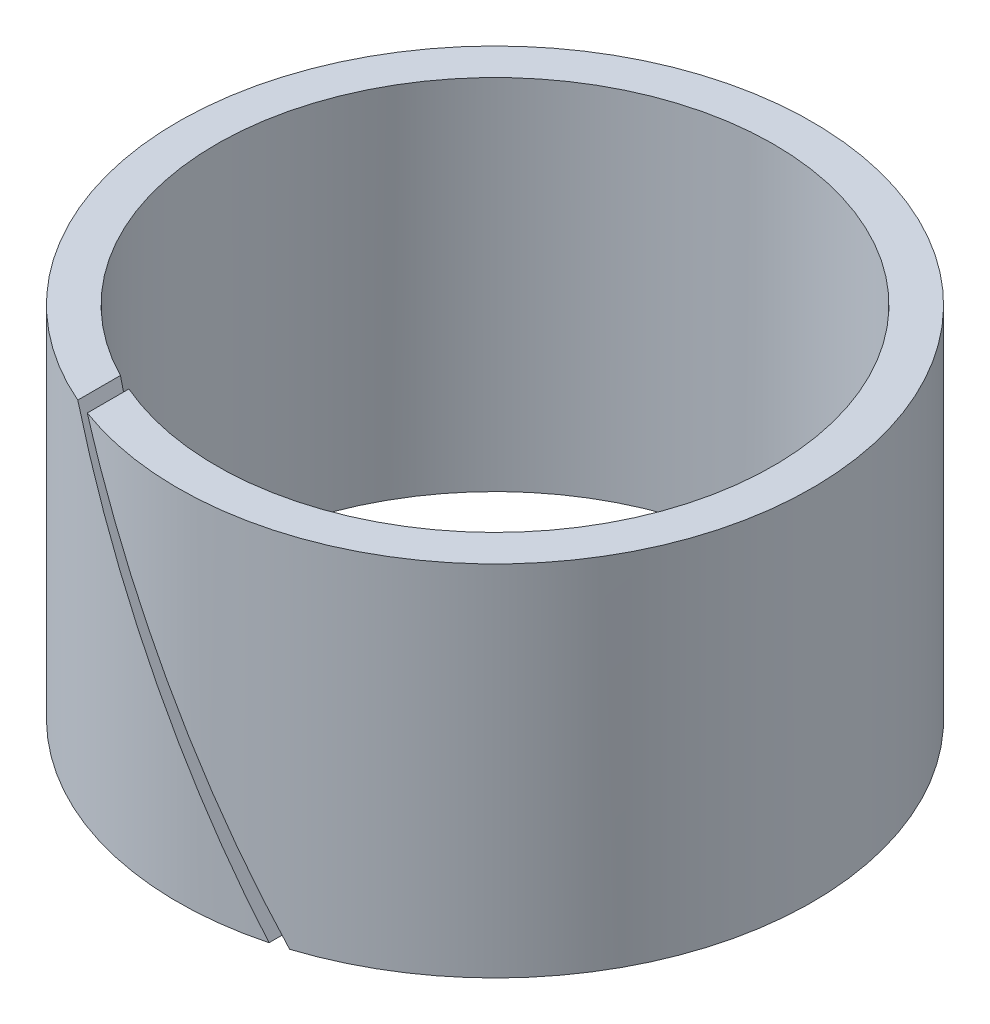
ISO-10303-21;
HEADER;
FILE_DESCRIPTION(('STEP AP214'),'2;1');
FILE_NAME('part.step','',(''),(''),'','','');
FILE_SCHEMA(('AUTOMOTIVE_DESIGN { 1 0 10303 214 1 1 1 1 }'));
ENDSEC;
DATA;
#1=APPLICATION_CONTEXT('core data for automotive mechanical design processes');
#2=APPLICATION_PROTOCOL_DEFINITION('international standard','automotive_design',2000,#1);
#3=PRODUCT_CONTEXT('',#1,'mechanical');
#4=PRODUCT('Part','Part','',(#3));
#5=PRODUCT_RELATED_PRODUCT_CATEGORY('part','',(#4));
#6=PRODUCT_DEFINITION_FORMATION('','',#4);
#7=PRODUCT_DEFINITION_CONTEXT('part definition',#1,'design');
#8=PRODUCT_DEFINITION('design','',#6,#7);
#9=PRODUCT_DEFINITION_SHAPE('','',#8);
#10=(LENGTH_UNIT() NAMED_UNIT(*) SI_UNIT(.MILLI.,.METRE.));
#11=(NAMED_UNIT(*) PLANE_ANGLE_UNIT() SI_UNIT($,.RADIAN.));
#12=(NAMED_UNIT(*) SI_UNIT($,.STERADIAN.) SOLID_ANGLE_UNIT());
#13=UNCERTAINTY_MEASURE_WITH_UNIT(LENGTH_MEASURE(1.E-05),#10,'distance_accuracy_value','');
#14=(GEOMETRIC_REPRESENTATION_CONTEXT(3) GLOBAL_UNCERTAINTY_ASSIGNED_CONTEXT((#13)) GLOBAL_UNIT_ASSIGNED_CONTEXT((#10,
#11,#12)) REPRESENTATION_CONTEXT('',''));
#15=CARTESIAN_POINT('',(0.,0.,0.));
#16=DIRECTION('',(0.,0.,1.));
#17=DIRECTION('',(1.,0.,0.));
#18=AXIS2_PLACEMENT_3D('',#15,#16,#17);
#19=CARTESIAN_POINT('',(0.,6.90869988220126,0.));
#20=DIRECTION('',(0.,1.,0.));
#21=DIRECTION('',(0.,0.,1.));
#22=AXIS2_PLACEMENT_3D('',#19,#20,#21);
#23=CYLINDRICAL_SURFACE('',#22,10.1);
#24=CARTESIAN_POINT('',(0.,-6.92820323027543,0.));
#25=DIRECTION('',(-0.866025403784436,-0.500000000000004,0.));
#26=DIRECTION('',(-0.500000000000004,0.866025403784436,0.));
#27=AXIS2_PLACEMENT_3D('',#24,#25,#26);
#28=ELLIPSE('',#27,20.1999999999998,10.1);
#29=CARTESIAN_POINT('',(-4.,0.,9.27415764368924));
#30=VERTEX_POINT('',#29);
#31=CARTESIAN_POINT('',(3.50555349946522,-13.,9.47212197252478));
#32=VERTEX_POINT('',#31);
#33=EDGE_CURVE('E98',#30,#32,#28,.F.);
#34=ORIENTED_EDGE('',*,*,#33,.F.);
#35=CARTESIAN_POINT('',(0.,0.,0.));
#36=DIRECTION('',(0.,1.,0.));
#37=DIRECTION('',(0.,0.,1.));
#38=AXIS2_PLACEMENT_3D('',#35,#36,#37);
#39=CIRCLE('',#38,10.1);
#40=CARTESIAN_POINT('',(-4.57735026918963,0.,9.00321412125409));
#41=VERTEX_POINT('',#40);
#42=EDGE_CURVE('E93',#30,#41,#39,.T.);
#43=ORIENTED_EDGE('',*,*,#42,.T.);
#44=CARTESIAN_POINT('',(0.,-7.92820323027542,0.));
#45=DIRECTION('',(0.866025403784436,0.500000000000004,0.));
#46=DIRECTION('',(-0.500000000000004,0.866025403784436,0.));
#47=AXIS2_PLACEMENT_3D('',#44,#45,#46);
#48=ELLIPSE('',#47,20.1999999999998,10.1);
#49=CARTESIAN_POINT('',(2.92820323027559,-13.,9.66621052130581));
#50=VERTEX_POINT('',#49);
#51=EDGE_CURVE('E54',#50,#41,#48,.F.);
#52=ORIENTED_EDGE('',*,*,#51,.F.);
#53=CARTESIAN_POINT('',(0.,-13.,0.));
#54=DIRECTION('',(0.,1.,0.));
#55=DIRECTION('',(0.,0.,1.));
#56=AXIS2_PLACEMENT_3D('',#53,#54,#55);
#57=CIRCLE('',#56,10.1);
#58=EDGE_CURVE('E86',#32,#50,#57,.T.);
#59=ORIENTED_EDGE('',*,*,#58,.F.);
#60=EDGE_LOOP('',(#34,#43,#52,#59));
#61=FACE_BOUND('',#60,.T.);
#62=ADVANCED_FACE('F33',(#61),#23,.F.);
#63=CARTESIAN_POINT('',(0.,-13.,-10.1));
#64=DIRECTION('',(0.,1.,0.));
#65=DIRECTION('',(0.,0.,1.));
#66=AXIS2_PLACEMENT_3D('',#63,#64,#65);
#67=PLANE('',#66);
#68=DIRECTION('',(0.,0.,-1.));
#69=VECTOR('',#68,1.);
#70=CARTESIAN_POINT('',(3.50555349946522,-13.,11.5));
#71=LINE('',#70,#69);
#72=CARTESIAN_POINT('',(3.50555349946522,-13.,10.9526752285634));
#73=VERTEX_POINT('',#72);
#74=EDGE_CURVE('E87',#73,#32,#71,.T.);
#75=ORIENTED_EDGE('',*,*,#74,.T.);
#76=ORIENTED_EDGE('',*,*,#58,.T.);
#77=DIRECTION('',(0.,0.,-1.));
#78=VECTOR('',#77,1.);
#79=CARTESIAN_POINT('',(2.92820323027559,-13.,11.5));
#80=LINE('',#79,#78);
#81=CARTESIAN_POINT('',(2.92820323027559,-13.,11.1209543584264));
#82=VERTEX_POINT('',#81);
#83=EDGE_CURVE('E73',#82,#50,#80,.T.);
#84=ORIENTED_EDGE('',*,*,#83,.F.);
#85=CARTESIAN_POINT('',(0.,-13.,0.));
#86=DIRECTION('',(0.,1.,0.));
#87=DIRECTION('',(0.,0.,1.));
#88=AXIS2_PLACEMENT_3D('',#85,#86,#87);
#89=CIRCLE('',#88,11.5);
#90=EDGE_CURVE('E84',#73,#82,#89,.T.);
#91=ORIENTED_EDGE('',*,*,#90,.F.);
#92=EDGE_LOOP('',(#75,#76,#84,#91));
#93=FACE_BOUND('',#92,.T.);
#94=ADVANCED_FACE('F83',(#93),#67,.F.);
#95=CARTESIAN_POINT('',(0.,6.90869988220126,0.));
#96=DIRECTION('',(0.,1.,0.));
#97=DIRECTION('',(0.,0.,1.));
#98=AXIS2_PLACEMENT_3D('',#95,#96,#97);
#99=CYLINDRICAL_SURFACE('',#98,11.5);
#100=CARTESIAN_POINT('',(0.,-6.92820323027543,0.));
#101=DIRECTION('',(-0.866025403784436,-0.500000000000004,0.));
#102=DIRECTION('',(-0.500000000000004,0.866025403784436,0.));
#103=AXIS2_PLACEMENT_3D('',#100,#101,#102);
#104=ELLIPSE('',#103,22.9999999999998,11.5);
#105=CARTESIAN_POINT('',(-4.,0.,10.7819293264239));
#106=VERTEX_POINT('',#105);
#107=EDGE_CURVE('E46',#73,#106,#104,.T.);
#108=ORIENTED_EDGE('',*,*,#107,.F.);
#109=ORIENTED_EDGE('',*,*,#90,.T.);
#110=CARTESIAN_POINT('',(0.,-7.92820323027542,0.));
#111=DIRECTION('',(0.866025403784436,0.500000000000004,0.));
#112=DIRECTION('',(-0.500000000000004,0.866025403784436,0.));
#113=AXIS2_PLACEMENT_3D('',#110,#111,#112);
#114=ELLIPSE('',#113,22.9999999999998,11.5);
#115=CARTESIAN_POINT('',(-4.57735026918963,0.,10.5497803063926));
#116=VERTEX_POINT('',#115);
#117=EDGE_CURVE('E70',#116,#82,#114,.T.);
#118=ORIENTED_EDGE('',*,*,#117,.F.);
#119=CARTESIAN_POINT('',(0.,0.,0.));
#120=DIRECTION('',(0.,1.,0.));
#121=DIRECTION('',(0.,0.,1.));
#122=AXIS2_PLACEMENT_3D('',#119,#120,#121);
#123=CIRCLE('',#122,11.5);
#124=EDGE_CURVE('E90',#106,#116,#123,.T.);
#125=ORIENTED_EDGE('',*,*,#124,.F.);
#126=EDGE_LOOP('',(#108,#109,#118,#125));
#127=FACE_BOUND('',#126,.T.);
#128=ADVANCED_FACE('F89',(#127),#99,.T.);
#129=CARTESIAN_POINT('',(0.,0.,-10.1));
#130=DIRECTION('',(0.,-1.,0.));
#131=DIRECTION('',(0.,0.,-1.));
#132=AXIS2_PLACEMENT_3D('',#129,#130,#131);
#133=PLANE('',#132);
#134=DIRECTION('',(0.,0.,-1.));
#135=VECTOR('',#134,1.);
#136=CARTESIAN_POINT('',(-4.,0.,-10.1));
#137=LINE('',#136,#135);
#138=EDGE_CURVE('E11',#106,#30,#137,.T.);
#139=ORIENTED_EDGE('',*,*,#138,.F.);
#140=ORIENTED_EDGE('',*,*,#124,.T.);
#141=DIRECTION('',(0.,0.,1.));
#142=VECTOR('',#141,1.);
#143=CARTESIAN_POINT('',(-4.57735026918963,0.,-10.1));
#144=LINE('',#143,#142);
#145=EDGE_CURVE('E40',#41,#116,#144,.T.);
#146=ORIENTED_EDGE('',*,*,#145,.F.);
#147=ORIENTED_EDGE('',*,*,#42,.F.);
#148=EDGE_LOOP('',(#139,#140,#146,#147));
#149=FACE_BOUND('',#148,.T.);
#150=ADVANCED_FACE('F106',(#149),#133,.F.);
#151=CARTESIAN_POINT('',(-4.57735026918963,0.,11.5));
#152=DIRECTION('',(0.866025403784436,0.500000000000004,0.));
#153=DIRECTION('',(-0.500000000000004,0.866025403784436,0.));
#154=AXIS2_PLACEMENT_3D('',#151,#152,#153);
#155=PLANE('',#154);
#156=ORIENTED_EDGE('',*,*,#51,.T.);
#157=ORIENTED_EDGE('',*,*,#145,.T.);
#158=ORIENTED_EDGE('',*,*,#117,.T.);
#159=ORIENTED_EDGE('',*,*,#83,.T.);
#160=EDGE_LOOP('',(#156,#157,#158,#159));
#161=FACE_BOUND('',#160,.T.);
#162=ADVANCED_FACE('F72',(#161),#155,.T.);
#163=CARTESIAN_POINT('',(-4.,0.,11.5));
#164=DIRECTION('',(-0.866025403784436,-0.500000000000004,0.));
#165=DIRECTION('',(0.500000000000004,-0.866025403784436,0.));
#166=AXIS2_PLACEMENT_3D('',#163,#164,#165);
#167=PLANE('',#166);
#168=ORIENTED_EDGE('',*,*,#33,.T.);
#169=ORIENTED_EDGE('',*,*,#74,.F.);
#170=ORIENTED_EDGE('',*,*,#107,.T.);
#171=ORIENTED_EDGE('',*,*,#138,.T.);
#172=EDGE_LOOP('',(#168,#169,#170,#171));
#173=FACE_BOUND('',#172,.T.);
#174=ADVANCED_FACE('F107',(#173),#167,.T.);
#175=CLOSED_SHELL('',(#62,#94,#128,#150,#162,#174));
#176=MANIFOLD_SOLID_BREP('B2',#175);
#177=ADVANCED_BREP_SHAPE_REPRESENTATION('',(#18,#176),#14);
#178=SHAPE_DEFINITION_REPRESENTATION(#9,#177);
ENDSEC;
END-ISO-10303-21;
